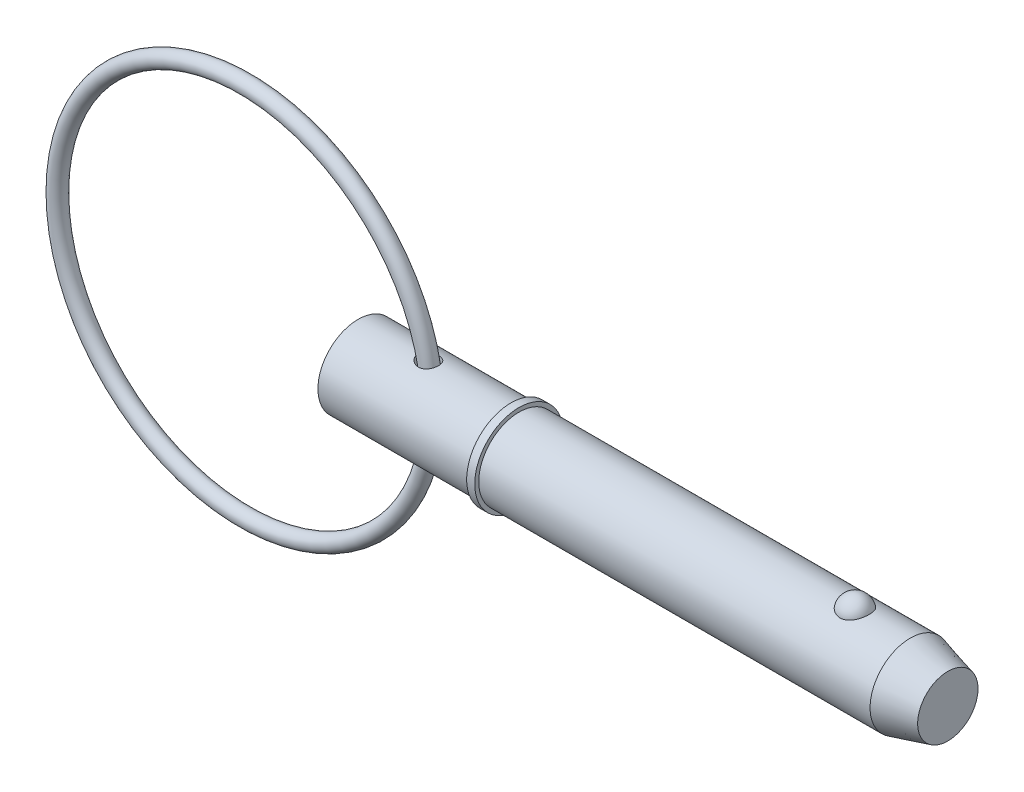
ISO-10303-21;
HEADER;
FILE_DESCRIPTION(('STEP AP214'),'2;1');
FILE_NAME('part.step','',(''),(''),'','','');
FILE_SCHEMA(('AUTOMOTIVE_DESIGN { 1 0 10303 214 1 1 1 1 }'));
ENDSEC;
DATA;
#1=APPLICATION_CONTEXT('core data for automotive mechanical design processes');
#2=APPLICATION_PROTOCOL_DEFINITION('international standard','automotive_design',2000,#1);
#3=PRODUCT_CONTEXT('',#1,'mechanical');
#4=PRODUCT('Part','Part','',(#3));
#5=PRODUCT_RELATED_PRODUCT_CATEGORY('part','',(#4));
#6=PRODUCT_DEFINITION_FORMATION('','',#4);
#7=PRODUCT_DEFINITION_CONTEXT('part definition',#1,'design');
#8=PRODUCT_DEFINITION('design','',#6,#7);
#9=PRODUCT_DEFINITION_SHAPE('','',#8);
#10=(LENGTH_UNIT() NAMED_UNIT(*) SI_UNIT(.MILLI.,.METRE.));
#11=(NAMED_UNIT(*) PLANE_ANGLE_UNIT() SI_UNIT($,.RADIAN.));
#12=(NAMED_UNIT(*) SI_UNIT($,.STERADIAN.) SOLID_ANGLE_UNIT());
#13=UNCERTAINTY_MEASURE_WITH_UNIT(LENGTH_MEASURE(1.E-05),#10,'distance_accuracy_value','');
#14=(GEOMETRIC_REPRESENTATION_CONTEXT(3) GLOBAL_UNCERTAINTY_ASSIGNED_CONTEXT((#13)) GLOBAL_UNIT_ASSIGNED_CONTEXT((#10,
#11,#12)) REPRESENTATION_CONTEXT('',''));
#15=CARTESIAN_POINT('',(0.,0.,0.));
#16=DIRECTION('',(0.,0.,1.));
#17=DIRECTION('',(1.,0.,0.));
#18=AXIS2_PLACEMENT_3D('',#15,#16,#17);
#19=CARTESIAN_POINT('',(-13.4013067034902,0.,0.));
#20=DIRECTION('',(0.,0.,1.));
#21=DIRECTION('',(1.,0.,0.));
#22=AXIS2_PLACEMENT_3D('',#19,#20,#21);
#23=TOROIDAL_SURFACE('',#22,22.225,0.952999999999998);
#24=CARTESIAN_POINT('',(9.77669329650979,0.,0.));
#25=VERTEX_POINT('',#24);
#26=VERTEX_LOOP('',#25);
#27=FACE_BOUND('',#26,.T.);
#28=ADVANCED_FACE('P0_F12',(#27),#23,.T.);
#29=CLOSED_SHELL('',(#28));
#30=MANIFOLD_SOLID_BREP('P0_B1',#29);
#31=CARTESIAN_POINT('',(0.,0.,0.));
#32=DIRECTION('',(1.,0.,0.));
#33=DIRECTION('',(0.,0.,-1.));
#34=AXIS2_PLACEMENT_3D('',#31,#32,#33);
#35=CYLINDRICAL_SURFACE('',#34,4.765);
#36=CARTESIAN_POINT('',(7.31773584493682,4.71580709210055,-0.682926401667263));
#37=CARTESIAN_POINT('',(7.3607471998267,4.70750812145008,-0.740230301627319));
#38=CARTESIAN_POINT('',(7.40883112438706,4.69869300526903,-0.79371122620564));
#39=CARTESIAN_POINT('',(7.51340999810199,4.68106981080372,-0.89180043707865));
#40=CARTESIAN_POINT('',(7.56991882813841,4.67226176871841,-0.936393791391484));
#41=CARTESIAN_POINT('',(7.689548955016,4.65568581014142,-1.01560363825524));
#42=CARTESIAN_POINT('',(7.75265928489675,4.64791621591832,-1.05023633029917));
#43=CARTESIAN_POINT('',(7.88387110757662,4.6343185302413,-1.10870278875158));
#44=CARTESIAN_POINT('',(7.95197058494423,4.62848966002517,-1.13254088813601));
#45=CARTESIAN_POINT('',(8.09209413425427,4.6194749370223,-1.16877415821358));
#46=CARTESIAN_POINT('',(8.16415141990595,4.6163169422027,-1.18104886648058));
#47=CARTESIAN_POINT('',(8.30937958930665,4.61324608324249,-1.19299123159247));
#48=CARTESIAN_POINT('',(8.38255011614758,4.61333220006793,-1.19266284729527));
#49=CARTESIAN_POINT('',(8.52374186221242,4.61674026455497,-1.17939593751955));
#50=CARTESIAN_POINT('',(8.59183022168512,4.61989017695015,-1.16712781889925));
#51=CARTESIAN_POINT('',(8.72470143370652,4.62884731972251,-1.13107903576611));
#52=CARTESIAN_POINT('',(8.78948513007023,4.63465386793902,-1.10730132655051));
#53=CARTESIAN_POINT('',(8.91088768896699,4.64792402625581,-1.05016249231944));
#54=CARTESIAN_POINT('',(8.96774302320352,4.65530108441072,-1.01728198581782));
#55=CARTESIAN_POINT('',(9.07499804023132,4.67102002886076,-0.942471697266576));
#56=CARTESIAN_POINT('',(9.12539777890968,4.6793619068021,-0.900541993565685));
#57=CARTESIAN_POINT('',(9.21836221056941,4.69607497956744,-0.808868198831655));
#58=CARTESIAN_POINT('',(9.26093651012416,4.70444612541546,-0.759133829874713));
#59=CARTESIAN_POINT('',(9.33728390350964,4.72032100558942,-0.653192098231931));
#60=CARTESIAN_POINT('',(9.3710564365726,4.72782468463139,-0.596984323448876));
#61=CARTESIAN_POINT('',(9.42940600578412,4.74126034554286,-0.478808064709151));
#62=CARTESIAN_POINT('',(9.45384681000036,4.74716869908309,-0.416769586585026));
#63=CARTESIAN_POINT('',(9.49226260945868,4.75663465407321,-0.289362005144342));
#64=CARTESIAN_POINT('',(9.50623742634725,4.76019221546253,-0.22399284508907));
#65=CARTESIAN_POINT('',(9.52342004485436,4.76458450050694,-0.0914886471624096));
#66=CARTESIAN_POINT('',(9.52658321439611,4.7654079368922,-0.0243474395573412));
#67=CARTESIAN_POINT('',(9.52194012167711,4.76421136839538,0.109528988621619));
#68=CARTESIAN_POINT('',(9.51413380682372,4.7621913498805,0.176264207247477));
#69=CARTESIAN_POINT('',(9.48775485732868,4.75552896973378,0.307367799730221));
#70=CARTESIAN_POINT('',(9.4691926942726,4.75088915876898,0.371738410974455));
#71=CARTESIAN_POINT('',(9.42175836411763,4.73949008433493,0.496364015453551));
#72=CARTESIAN_POINT('',(9.39288586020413,4.73273075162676,0.556618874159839));
#73=CARTESIAN_POINT('',(9.32549385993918,4.71782154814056,0.671371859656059));
#74=CARTESIAN_POINT('',(9.28696367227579,4.70967013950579,0.725863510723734));
#75=CARTESIAN_POINT('',(9.20123305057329,4.6928883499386,0.827453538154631));
#76=CARTESIAN_POINT('',(9.15403300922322,4.68425799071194,0.874552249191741));
#77=CARTESIAN_POINT('',(9.05250467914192,4.66754854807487,0.959736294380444));
#78=CARTESIAN_POINT('',(8.99822095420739,4.65946646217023,0.997874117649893));
#79=CARTESIAN_POINT('',(8.88381123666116,4.64472049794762,1.06440739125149));
#80=CARTESIAN_POINT('',(8.82368614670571,4.63805640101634,1.09280434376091));
#81=CARTESIAN_POINT('',(8.70022952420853,4.62698068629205,1.13878427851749));
#82=CARTESIAN_POINT('',(8.63695594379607,4.62253830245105,1.15651569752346));
#83=CARTESIAN_POINT('',(8.50825296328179,4.61622454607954,1.18146656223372));
#84=CARTESIAN_POINT('',(8.44282353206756,4.61435321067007,1.18868585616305));
#85=CARTESIAN_POINT('',(8.31119087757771,4.61332122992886,1.19268442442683));
#86=CARTESIAN_POINT('',(8.24498542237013,4.61417920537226,1.18939198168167));
#87=CARTESIAN_POINT('',(8.11397487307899,4.61847671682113,1.17259121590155));
#88=CARTESIAN_POINT('',(8.04917011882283,4.62191687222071,1.15908044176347));
#89=CARTESIAN_POINT('',(7.91946226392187,4.63117528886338,1.12153047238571));
#90=CARTESIAN_POINT('',(7.85470460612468,4.6371000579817,1.09701575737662));
#91=CARTESIAN_POINT('',(7.7300035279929,4.65063246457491,1.03814807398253));
#92=CARTESIAN_POINT('',(7.67006197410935,4.65824075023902,1.00379131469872));
#93=CARTESIAN_POINT('',(7.55352765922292,4.67473656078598,0.924015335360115));
#94=CARTESIAN_POINT('',(7.49726947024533,4.68366994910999,0.878115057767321));
#95=CARTESIAN_POINT('',(7.39344083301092,4.70144936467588,0.777311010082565));
#96=CARTESIAN_POINT('',(7.34587087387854,4.71029538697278,0.722406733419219));
#97=CARTESIAN_POINT('',(7.26188955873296,4.72669773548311,0.605773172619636));
#98=CARTESIAN_POINT('',(7.22531316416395,4.73427229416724,0.544165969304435));
#99=CARTESIAN_POINT('',(7.16406269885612,4.74732663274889,0.415095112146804));
#100=CARTESIAN_POINT('',(7.13937848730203,4.75280819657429,0.347636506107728));
#101=CARTESIAN_POINT('',(7.10494917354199,4.7605495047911,0.215359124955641));
#102=CARTESIAN_POINT('',(7.09405441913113,4.76305589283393,0.150853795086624));
#103=CARTESIAN_POINT('',(7.08387189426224,4.76539656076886,0.0208839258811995));
#104=CARTESIAN_POINT('',(7.0845805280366,4.76523166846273,-0.0445803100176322));
#105=CARTESIAN_POINT('',(7.09709111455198,4.76236014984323,-0.169693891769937));
#106=CARTESIAN_POINT('',(7.10810913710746,4.75983315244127,-0.229428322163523));
#107=CARTESIAN_POINT('',(7.13959099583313,4.75276726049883,-0.346187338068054));
#108=CARTESIAN_POINT('',(7.16004881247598,4.7482296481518,-0.403213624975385));
#109=CARTESIAN_POINT('',(7.20270325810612,4.73907067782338,-0.498040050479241));
#110=CARTESIAN_POINT('',(7.22286864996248,4.73481668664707,-0.536809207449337));
#111=CARTESIAN_POINT('',(7.26730952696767,4.72570777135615,-0.611832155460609));
#112=CARTESIAN_POINT('',(7.29158512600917,4.72085283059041,-0.64808587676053));
#113=CARTESIAN_POINT('',(7.31773584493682,4.71580709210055,-0.682926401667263));
#114=B_SPLINE_CURVE_WITH_KNOTS('',3,(#36,#37,#38,#39,#40,#41,#42,#43,#44,#45,#46,#47,#48,#49,
#50,#51,#52,#53,#54,#55,#56,#57,#58,#59,#60,#61,#62,#63,#64,#65,#66,#67,#68,#69,#70,#71,#72,#73,
#74,#75,#76,#77,#78,#79,#80,#81,#82,#83,#84,#85,#86,#87,#88,#89,#90,#91,#92,#93,#94,#95,#96,#97,
#98,#99,#100,#101,#102,#103,#104,#105,#106,#107,#108,#109,#110,#111,#112,#113),.UNSPECIFIED.,
.T.,.F.,(4,2,2,2,2,2,2,2,2,2,2,2,2,2,2,2,2,2,2,2,2,2,2,2,2,2,2,2,2,2,2,2,2,2,2,2,2,2,4),(0.,
0.216219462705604,0.432799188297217,0.649024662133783,0.865163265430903,1.08352938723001,
1.30182691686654,1.50853487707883,1.71518978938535,1.91252381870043,2.1098561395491,
2.30694457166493,2.50404555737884,2.70392296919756,2.90380378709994,3.10450875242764,
3.30521468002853,3.5057255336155,3.70624293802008,3.90698330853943,4.10771458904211,
4.30723900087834,4.50673262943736,4.70338139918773,4.90003300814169,5.09802914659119,
5.29607279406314,5.5036500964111,5.7113074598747,5.92972727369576,6.14815938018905,
6.36312650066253,6.57790998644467,6.77325899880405,6.96854747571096,7.15009726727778,
7.33153144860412,7.46298830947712,7.59444881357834),.UNSPECIFIED.);
#115=CARTESIAN_POINT('',(7.31773584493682,4.71580709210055,-0.682926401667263));
#116=VERTEX_POINT('',#115);
#117=EDGE_CURVE('P1_E42',#116,#116,#114,.T.);
#118=ORIENTED_EDGE('',*,*,#117,.T.);
#119=EDGE_LOOP('',(#118));
#120=FACE_BOUND('',#119,.T.);
#121=CARTESIAN_POINT('',(0.,0.,0.));
#122=DIRECTION('',(1.,0.,0.));
#123=DIRECTION('',(0.,0.,-1.));
#124=AXIS2_PLACEMENT_3D('',#121,#122,#123);
#125=CIRCLE('',#124,4.765);
#126=CARTESIAN_POINT('',(0.,0.,-4.765));
#127=VERTEX_POINT('',#126);
#128=EDGE_CURVE('P1_E9',#127,#127,#125,.T.);
#129=ORIENTED_EDGE('',*,*,#128,.T.);
#130=EDGE_LOOP('',(#129));
#131=FACE_BOUND('',#130,.T.);
#132=CARTESIAN_POINT('',(18.097,0.,0.));
#133=DIRECTION('',(1.,0.,0.));
#134=DIRECTION('',(0.,0.,-1.));
#135=AXIS2_PLACEMENT_3D('',#132,#133,#134);
#136=CIRCLE('',#135,4.765);
#137=CARTESIAN_POINT('',(18.097,0.,-4.765));
#138=VERTEX_POINT('',#137);
#139=EDGE_CURVE('P1_E25',#138,#138,#136,.T.);
#140=ORIENTED_EDGE('',*,*,#139,.F.);
#141=EDGE_LOOP('',(#140));
#142=FACE_BOUND('',#141,.T.);
#143=CARTESIAN_POINT('',(7.31773584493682,-4.71580709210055,-0.682926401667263));
#144=CARTESIAN_POINT('',(7.27956054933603,-4.72317282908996,-0.63206220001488));
#145=CARTESIAN_POINT('',(7.24535712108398,-4.7301361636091,-0.578155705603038));
#146=CARTESIAN_POINT('',(7.18611785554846,-4.74256090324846,-0.465352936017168));
#147=CARTESIAN_POINT('',(7.16107836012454,-4.74802290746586,-0.406458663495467));
#148=CARTESIAN_POINT('',(7.12119149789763,-4.75686558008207,-0.284913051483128));
#149=CARTESIAN_POINT('',(7.1063796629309,-4.76023898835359,-0.222249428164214));
#150=CARTESIAN_POINT('',(7.08786546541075,-4.76447177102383,-0.0952170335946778));
#151=CARTESIAN_POINT('',(7.08416018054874,-4.76533180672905,-0.0308487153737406));
#152=CARTESIAN_POINT('',(7.08795686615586,-4.76445764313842,0.0942755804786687));
#153=CARTESIAN_POINT('',(7.09490366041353,-4.762851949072,0.155050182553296));
#154=CARTESIAN_POINT('',(7.11863973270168,-4.75746086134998,0.2745356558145));
#155=CARTESIAN_POINT('',(7.13542953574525,-4.75367535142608,0.333246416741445));
#156=CARTESIAN_POINT('',(7.17817193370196,-4.74430545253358,0.447305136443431));
#157=CARTESIAN_POINT('',(7.20415836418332,-4.73871442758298,0.502639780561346));
#158=CARTESIAN_POINT('',(7.26428068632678,-4.72628508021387,0.608523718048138));
#159=CARTESIAN_POINT('',(7.29841897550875,-4.71944639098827,0.659071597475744));
#160=CARTESIAN_POINT('',(7.37680984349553,-4.70456239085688,0.758311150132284));
#161=CARTESIAN_POINT('',(7.42165519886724,-4.69646426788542,0.806526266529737));
#162=CARTESIAN_POINT('',(7.51828933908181,-4.68032890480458,0.895428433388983));
#163=CARTESIAN_POINT('',(7.57008134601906,-4.67229169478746,0.936111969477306));
#164=CARTESIAN_POINT('',(7.68397204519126,-4.65640659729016,1.01229731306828));
#165=CARTESIAN_POINT('',(7.74657226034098,-4.64863251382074,1.04706751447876));
#166=CARTESIAN_POINT('',(7.87680110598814,-4.6349740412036,1.10596507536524));
#167=CARTESIAN_POINT('',(7.94443054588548,-4.62908995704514,1.13009071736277));
#168=CARTESIAN_POINT('',(8.08402017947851,-4.61989019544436,1.16713943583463));
#169=CARTESIAN_POINT('',(8.15603143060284,-4.61661596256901,1.17988211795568));
#170=CARTESIAN_POINT('',(8.30124697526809,-4.61330446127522,1.1927680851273));
#171=CARTESIAN_POINT('',(8.37445077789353,-4.61326589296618,1.19291642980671));
#172=CARTESIAN_POINT('',(8.51584800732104,-4.61644036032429,1.18056687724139));
#173=CARTESIAN_POINT('',(8.58410302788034,-4.61948317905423,1.16873099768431));
#174=CARTESIAN_POINT('',(8.71738052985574,-4.6282520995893,1.13350536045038));
#175=CARTESIAN_POINT('',(8.78240382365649,-4.63397752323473,1.11011852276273));
#176=CARTESIAN_POINT('',(8.90428519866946,-4.64711877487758,1.05371003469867));
#177=CARTESIAN_POINT('',(8.96138096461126,-4.6544450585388,1.02117932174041));
#178=CARTESIAN_POINT('',(9.06916653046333,-4.6700970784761,0.947021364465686));
#179=CARTESIAN_POINT('',(9.11985639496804,-4.67842280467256,0.905394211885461));
#180=CARTESIAN_POINT('',(9.2134071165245,-4.69513303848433,0.814300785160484));
#181=CARTESIAN_POINT('',(9.25628268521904,-4.70351740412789,0.764849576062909));
#182=CARTESIAN_POINT('',(9.33327173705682,-4.71945185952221,0.659422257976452));
#183=CARTESIAN_POINT('',(9.3673846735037,-4.72700189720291,0.603445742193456));
#184=CARTESIAN_POINT('',(9.42645214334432,-4.74055953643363,0.485673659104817));
#185=CARTESIAN_POINT('',(9.45127042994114,-4.74654383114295,0.423807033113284));
#186=CARTESIAN_POINT('',(9.49046298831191,-4.756182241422,0.296676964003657));
#187=CARTESIAN_POINT('',(9.50483706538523,-4.75983631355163,0.231413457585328));
#188=CARTESIAN_POINT('',(9.52283408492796,-4.76443282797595,0.0990368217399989));
#189=CARTESIAN_POINT('',(9.52641016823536,-4.76536345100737,0.0319169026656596));
#190=CARTESIAN_POINT('',(9.52259067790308,-4.76437893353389,-0.101988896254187));
#191=CARTESIAN_POINT('',(9.5151950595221,-4.76246378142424,-0.168774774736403));
#192=CARTESIAN_POINT('',(9.48962516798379,-4.75599746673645,-0.300048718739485));
#193=CARTESIAN_POINT('',(9.4714615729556,-4.75144891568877,-0.364538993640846));
#194=CARTESIAN_POINT('',(9.42480303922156,-4.74020887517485,-0.489470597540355));
#195=CARTESIAN_POINT('',(9.396307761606,-4.73351731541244,-0.549911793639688));
#196=CARTESIAN_POINT('',(9.32963953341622,-4.71871240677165,-0.665099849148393));
#197=CARTESIAN_POINT('',(9.29145577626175,-4.71059747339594,-0.719840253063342));
#198=CARTESIAN_POINT('',(9.20637695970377,-4.69385254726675,-0.82198328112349));
#199=CARTESIAN_POINT('',(9.15948227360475,-4.68522257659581,-0.869386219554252));
#200=CARTESIAN_POINT('',(9.05849937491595,-4.66847516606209,-0.955233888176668));
#201=CARTESIAN_POINT('',(9.00445430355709,-4.6603550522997,-0.993728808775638));
#202=CARTESIAN_POINT('',(8.8904576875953,-4.64550122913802,-1.06100691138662));
#203=CARTESIAN_POINT('',(8.83050704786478,-4.63876730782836,-1.08979157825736));
#204=CARTESIAN_POINT('',(8.70732873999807,-4.6275305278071,-1.13655620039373));
#205=CARTESIAN_POINT('',(8.64416019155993,-4.62299714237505,-1.15468477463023));
#206=CARTESIAN_POINT('',(8.51559711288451,-4.61649071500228,-1.18043067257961));
#207=CARTESIAN_POINT('',(8.4502025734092,-4.61451768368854,-1.18804795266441));
#208=CARTESIAN_POINT('',(8.31862013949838,-4.61328355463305,-1.19283094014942));
#209=CARTESIAN_POINT('',(8.25242983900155,-4.61403911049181,-1.18993246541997));
#210=CARTESIAN_POINT('',(8.12138461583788,-4.61814057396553,-1.17391149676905));
#211=CARTESIAN_POINT('',(8.0565300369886,-4.62148714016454,-1.16078640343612));
#212=CARTESIAN_POINT('',(7.92669960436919,-4.63056912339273,-1.12402333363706));
#213=CARTESIAN_POINT('',(7.86186447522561,-4.63641051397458,-1.09991536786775));
#214=CARTESIAN_POINT('',(7.73694230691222,-4.64980121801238,-1.04185298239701));
#215=CARTESIAN_POINT('',(7.6768568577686,-4.65735110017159,-1.0078952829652));
#216=CARTESIAN_POINT('',(7.56207884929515,-4.67346080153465,-0.930364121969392));
#217=CARTESIAN_POINT('',(7.5074784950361,-4.68203382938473,-0.886656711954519));
#218=CARTESIAN_POINT('',(7.40624045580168,-4.69916824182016,-0.79082583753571));
#219=CARTESIAN_POINT('',(7.35959988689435,-4.7077296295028,-0.738705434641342));
#220=CARTESIAN_POINT('',(7.31773584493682,-4.71580709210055,-0.682926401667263));
#221=B_SPLINE_CURVE_WITH_KNOTS('',3,(#143,#144,#145,#146,#147,#148,#149,#150,#151,#152,#153,
#154,#155,#156,#157,#158,#159,#160,#161,#162,#163,#164,#165,#166,#167,#168,#169,#170,#171,#172,
#173,#174,#175,#176,#177,#178,#179,#180,#181,#182,#183,#184,#185,#186,#187,#188,#189,#190,#191,
#192,#193,#194,#195,#196,#197,#198,#199,#200,#201,#202,#203,#204,#205,#206,#207,#208,#209,#210,
#211,#212,#213,#214,#215,#216,#217,#218,#219,#220),.UNSPECIFIED.,.T.,.F.,(4,2,2,2,2,2,2,2,2,2,2,
2,2,2,2,2,2,2,2,2,2,2,2,2,2,2,2,2,2,2,2,2,2,2,2,2,2,2,4),(0.,0.191851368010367,0.38362606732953,
0.576063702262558,0.768450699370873,0.951145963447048,1.13385097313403,1.31723528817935,
1.50067360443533,1.69887079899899,1.8971602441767,2.11225870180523,2.32739185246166,
2.54587681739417,2.76427400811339,2.97123130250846,3.17813630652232,3.37555441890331,
3.57297054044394,3.77001106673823,3.96706388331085,4.16690159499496,4.36674303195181,
4.56745046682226,4.76815872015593,4.96866827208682,5.16918440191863,5.36992517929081,
5.5706573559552,5.77022940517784,5.96977092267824,6.16645904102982,6.36314797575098,
6.56103940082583,6.75898114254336,6.96633026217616,7.17374850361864,7.384214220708,
7.59460352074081),.UNSPECIFIED.);
#222=CARTESIAN_POINT('',(7.31773584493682,-4.71580709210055,-0.682926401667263));
#223=VERTEX_POINT('',#222);
#224=EDGE_CURVE('P1_E17',#223,#223,#221,.T.);
#225=ORIENTED_EDGE('',*,*,#224,.T.);
#226=EDGE_LOOP('',(#225));
#227=FACE_BOUND('',#226,.T.);
#228=ADVANCED_FACE('P1_F13',(#120,#131,#142,#227),#35,.T.);
#229=CARTESIAN_POINT('',(0.,0.,0.));
#230=DIRECTION('',(1.,0.,0.));
#231=DIRECTION('',(0.,0.,-1.));
#232=AXIS2_PLACEMENT_3D('',#229,#230,#231);
#233=CYLINDRICAL_SURFACE('',#232,4.765);
#234=CARTESIAN_POINT('',(65.4041944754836,0.,0.));
#235=DIRECTION('',(1.,0.,0.));
#236=DIRECTION('',(0.,0.,-1.));
#237=AXIS2_PLACEMENT_3D('',#234,#235,#236);
#238=CIRCLE('',#237,4.765);
#239=CARTESIAN_POINT('',(65.4041944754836,0.,-4.765));
#240=VERTEX_POINT('',#239);
#241=EDGE_CURVE('P1_E99',#240,#240,#238,.T.);
#242=ORIENTED_EDGE('',*,*,#241,.F.);
#243=EDGE_LOOP('',(#242));
#244=FACE_BOUND('',#243,.T.);
#245=CARTESIAN_POINT('',(19.05,0.,0.));
#246=DIRECTION('',(1.,0.,0.));
#247=DIRECTION('',(0.,0.,-1.));
#248=AXIS2_PLACEMENT_3D('',#245,#246,#247);
#249=CIRCLE('',#248,4.765);
#250=CARTESIAN_POINT('',(19.05,0.,-4.765));
#251=VERTEX_POINT('',#250);
#252=EDGE_CURVE('P1_E96',#251,#251,#249,.T.);
#253=ORIENTED_EDGE('',*,*,#252,.T.);
#254=EDGE_LOOP('',(#253));
#255=FACE_BOUND('',#254,.T.);
#256=CARTESIAN_POINT('',(58.8510202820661,4.42764777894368,1.76101111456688));
#257=CARTESIAN_POINT('',(58.7597212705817,4.42764470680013,1.76101422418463));
#258=CARTESIAN_POINT('',(58.6684468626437,4.43059091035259,1.75366340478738));
#259=CARTESIAN_POINT('',(58.4886154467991,4.44201846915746,1.72451180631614));
#260=CARTESIAN_POINT('',(58.4000577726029,4.45049845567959,1.70271460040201));
#261=CARTESIAN_POINT('',(58.2282570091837,4.47200516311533,1.64539370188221));
#262=CARTESIAN_POINT('',(58.1450064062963,4.48502527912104,1.60988994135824));
#263=CARTESIAN_POINT('',(57.9857633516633,4.51419542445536,1.52617873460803));
#264=CARTESIAN_POINT('',(57.9097723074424,4.53034605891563,1.47796883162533));
#265=CARTESIAN_POINT('',(57.7647445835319,4.5645931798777,1.36860494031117));
#266=CARTESIAN_POINT('',(57.6959645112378,4.58273170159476,1.30712420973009));
#267=CARTESIAN_POINT('',(57.5693423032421,4.61870302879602,1.17370204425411));
#268=CARTESIAN_POINT('',(57.5115021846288,4.63653577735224,1.10175868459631));
#269=CARTESIAN_POINT('',(57.4055709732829,4.67090140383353,0.945806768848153));
#270=CARTESIAN_POINT('',(57.3580305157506,4.68734068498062,0.861402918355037));
#271=CARTESIAN_POINT('',(57.2770817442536,4.71628466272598,0.68544236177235));
#272=CARTESIAN_POINT('',(57.2436747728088,4.72878898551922,0.593884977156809));
#273=CARTESIAN_POINT('',(57.191287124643,4.74874061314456,0.404781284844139));
#274=CARTESIAN_POINT('',(57.1725178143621,4.75611366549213,0.307168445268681));
#275=CARTESIAN_POINT('',(57.1505846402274,4.76475393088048,0.109940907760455));
#276=CARTESIAN_POINT('',(57.1474205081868,4.76602124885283,0.0103262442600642));
#277=CARTESIAN_POINT('',(57.1567405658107,4.76232928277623,-0.187629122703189));
#278=CARTESIAN_POINT('',(57.1691588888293,4.7573962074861,-0.285973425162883));
#279=CARTESIAN_POINT('',(57.2092804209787,4.74184975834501,-0.479027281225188));
#280=CARTESIAN_POINT('',(57.2369839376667,4.7312362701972,-0.573736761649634));
#281=CARTESIAN_POINT('',(57.3071581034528,4.70540026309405,-0.756973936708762));
#282=CARTESIAN_POINT('',(57.3496460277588,4.69017235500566,-0.845494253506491));
#283=CARTESIAN_POINT('',(57.448520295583,4.6566986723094,-1.01378033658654));
#284=CARTESIAN_POINT('',(57.5049076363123,4.63845268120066,-1.09354547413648));
#285=CARTESIAN_POINT('',(57.630552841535,4.60085438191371,-1.24228523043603));
#286=CARTESIAN_POINT('',(57.6998439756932,4.58149930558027,-1.31123108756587));
#287=CARTESIAN_POINT('',(57.8496066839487,4.54391653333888,-1.43607409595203));
#288=CARTESIAN_POINT('',(57.9300771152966,4.52568872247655,-1.49197257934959));
#289=CARTESIAN_POINT('',(58.0981500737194,4.49293007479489,-1.58786764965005));
#290=CARTESIAN_POINT('',(58.1855445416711,4.47832346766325,-1.62820219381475));
#291=CARTESIAN_POINT('',(58.366553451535,4.45406011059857,-1.69345757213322));
#292=CARTESIAN_POINT('',(58.4601655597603,4.44440151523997,-1.71838415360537));
#293=CARTESIAN_POINT('',(58.6458939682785,4.43159888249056,-1.75112843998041));
#294=CARTESIAN_POINT('',(58.737849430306,4.42815213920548,-1.75974223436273));
#295=CARTESIAN_POINT('',(58.9219658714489,4.427247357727,-1.76201865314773));
#296=CARTESIAN_POINT('',(59.0141268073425,4.42978816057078,-1.7556841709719));
#297=CARTESIAN_POINT('',(59.1931292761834,4.4403864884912,-1.72869560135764));
#298=CARTESIAN_POINT('',(59.2800474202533,4.44827555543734,-1.70847853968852));
#299=CARTESIAN_POINT('',(59.4491314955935,4.46852246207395,-1.65479562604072));
#300=CARTESIAN_POINT('',(59.5312970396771,4.48088066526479,-1.62132869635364));
#301=CARTESIAN_POINT('',(59.6905916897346,4.50907357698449,-1.54120560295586));
#302=CARTESIAN_POINT('',(59.7675700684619,4.52497884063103,-1.49427526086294));
#303=CARTESIAN_POINT('',(59.9127080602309,4.55845148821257,-1.38881222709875));
#304=CARTESIAN_POINT('',(59.9808656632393,4.57601924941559,-1.33027689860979));
#305=CARTESIAN_POINT('',(60.1100990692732,4.61196537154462,-1.19991049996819));
#306=CARTESIAN_POINT('',(60.1706562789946,4.63034074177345,-1.12756415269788));
#307=CARTESIAN_POINT('',(60.2792797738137,4.66513959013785,-0.973612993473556));
#308=CARTESIAN_POINT('',(60.3273438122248,4.68156271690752,-0.8920065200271));
#309=CARTESIAN_POINT('',(60.411383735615,4.71130224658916,-0.718892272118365));
#310=CARTESIAN_POINT('',(60.4469185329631,4.724501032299,-0.627149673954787));
#311=CARTESIAN_POINT('',(60.5029522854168,4.74571823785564,-0.438611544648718));
#312=CARTESIAN_POINT('',(60.523450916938,4.75373654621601,-0.341815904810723));
#313=CARTESIAN_POINT('',(60.5490338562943,4.76378905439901,-0.145633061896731));
#314=CARTESIAN_POINT('',(60.554076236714,4.76580697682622,-0.046239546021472));
#315=CARTESIAN_POINT('',(60.5485239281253,4.76360573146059,0.15203857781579));
#316=CARTESIAN_POINT('',(60.5379294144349,4.75938663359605,0.250923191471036));
#317=CARTESIAN_POINT('',(60.5013875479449,4.74516937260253,0.445004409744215));
#318=CARTESIAN_POINT('',(60.4754964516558,4.73519238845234,0.540213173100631));
#319=CARTESIAN_POINT('',(60.4089273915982,4.7104939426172,0.724662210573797));
#320=CARTESIAN_POINT('',(60.368248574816,4.69577220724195,0.81390214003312));
#321=CARTESIAN_POINT('',(60.2727177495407,4.66303767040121,0.984313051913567));
#322=CARTESIAN_POINT('',(60.2178042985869,4.64501070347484,1.06544688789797));
#323=CARTESIAN_POINT('',(60.0950496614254,4.60764678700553,1.21692673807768));
#324=CARTESIAN_POINT('',(60.0272086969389,4.58830985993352,1.2872729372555));
#325=CARTESIAN_POINT('',(59.8805480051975,4.55060370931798,1.41479271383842));
#326=CARTESIAN_POINT('',(59.8017918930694,4.53222967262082,1.47203785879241));
#327=CARTESIAN_POINT('',(59.6349890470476,4.49849576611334,1.57212016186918));
#328=CARTESIAN_POINT('',(59.5469417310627,4.48313608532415,1.61495641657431));
#329=CARTESIAN_POINT('',(59.3597918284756,4.45676184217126,1.68642657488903));
#330=CARTESIAN_POINT('',(59.2603653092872,4.44598302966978,1.71430590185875));
#331=CARTESIAN_POINT('',(59.0576210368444,4.43142918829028,1.75159258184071));
#332=CARTESIAN_POINT('',(58.9543049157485,4.42765125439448,1.76100759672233));
#333=CARTESIAN_POINT('',(58.8510202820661,4.42764777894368,1.76101111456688));
#334=B_SPLINE_CURVE_WITH_KNOTS('',3,(#256,#257,#258,#259,#260,#261,#262,#263,#264,#265,#266,
#267,#268,#269,#270,#271,#272,#273,#274,#275,#276,#277,#278,#279,#280,#281,#282,#283,#284,#285,
#286,#287,#288,#289,#290,#291,#292,#293,#294,#295,#296,#297,#298,#299,#300,#301,#302,#303,#304,
#305,#306,#307,#308,#309,#310,#311,#312,#313,#314,#315,#316,#317,#318,#319,#320,#321,#322,#323,
#324,#325,#326,#327,#328,#329,#330,#331,#332,#333),.UNSPECIFIED.,.T.,.F.,(4,2,2,2,2,2,2,2,2,2,2,
2,2,2,2,2,2,2,2,2,2,2,2,2,2,2,2,2,2,2,2,2,2,2,2,2,2,2,4),(0.,0.273517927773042,
0.546968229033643,0.820022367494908,1.09312934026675,1.37393946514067,1.65480131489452,
1.94820420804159,2.24163496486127,2.53922817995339,2.8368162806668,3.13315071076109,
3.42949110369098,3.72617893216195,4.02288805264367,4.32037303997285,4.61782764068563,
4.90840095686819,5.19886582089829,5.4747485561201,5.75057789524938,6.01809977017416,
6.28564340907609,6.55907787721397,6.83257454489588,7.11962987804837,7.40673679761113,
7.70312663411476,7.99952284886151,8.29672237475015,8.59391856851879,8.89002850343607,
9.18615552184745,9.483582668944,9.78100471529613,10.0767610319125,10.3725358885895,
10.6820893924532,10.991514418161),.UNSPECIFIED.);
#335=CARTESIAN_POINT('',(58.8510202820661,4.42764777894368,1.76101111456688));
#336=VERTEX_POINT('',#335);
#337=EDGE_CURVE('P1_E34',#336,#336,#334,.T.);
#338=ORIENTED_EDGE('',*,*,#337,.T.);
#339=EDGE_LOOP('',(#338));
#340=FACE_BOUND('',#339,.T.);
#341=ADVANCED_FACE('P1_F46',(#244,#255,#340),#233,.T.);
#342=CARTESIAN_POINT('',(0.,0.,0.));
#343=DIRECTION('',(-1.,0.,0.));
#344=DIRECTION('',(0.,0.,1.));
#345=AXIS2_PLACEMENT_3D('',#342,#343,#344);
#346=PLANE('',#345);
#347=ORIENTED_EDGE('',*,*,#128,.F.);
#348=EDGE_LOOP('',(#347));
#349=FACE_BOUND('',#348,.T.);
#350=ADVANCED_FACE('P1_F15',(#349),#346,.T.);
#351=CARTESIAN_POINT('',(18.097,4.765,0.));
#352=DIRECTION('',(-1.,0.,0.));
#353=DIRECTION('',(0.,0.,1.));
#354=AXIS2_PLACEMENT_3D('',#351,#352,#353);
#355=PLANE('',#354);
#356=ORIENTED_EDGE('',*,*,#139,.T.);
#357=EDGE_LOOP('',(#356));
#358=FACE_BOUND('',#357,.T.);
#359=CARTESIAN_POINT('',(18.097,0.,0.));
#360=DIRECTION('',(1.,0.,0.));
#361=DIRECTION('',(0.,0.,-1.));
#362=AXIS2_PLACEMENT_3D('',#359,#360,#361);
#363=CIRCLE('',#362,5.2415);
#364=CARTESIAN_POINT('',(18.097,0.,-5.2415));
#365=VERTEX_POINT('',#364);
#366=EDGE_CURVE('P1_E30',#365,#365,#363,.T.);
#367=ORIENTED_EDGE('',*,*,#366,.F.);
#368=EDGE_LOOP('',(#367));
#369=FACE_BOUND('',#368,.T.);
#370=ADVANCED_FACE('P1_F81',(#358,#369),#355,.T.);
#371=CARTESIAN_POINT('',(0.,0.,0.));
#372=DIRECTION('',(1.,0.,0.));
#373=DIRECTION('',(0.,0.,-1.));
#374=AXIS2_PLACEMENT_3D('',#371,#372,#373);
#375=CYLINDRICAL_SURFACE('',#374,5.2415);
#376=ORIENTED_EDGE('',*,*,#366,.T.);
#377=EDGE_LOOP('',(#376));
#378=FACE_BOUND('',#377,.T.);
#379=CARTESIAN_POINT('',(19.05,0.,0.));
#380=DIRECTION('',(1.,0.,0.));
#381=DIRECTION('',(0.,0.,-1.));
#382=AXIS2_PLACEMENT_3D('',#379,#380,#381);
#383=CIRCLE('',#382,5.2415);
#384=CARTESIAN_POINT('',(19.05,0.,-5.2415));
#385=VERTEX_POINT('',#384);
#386=EDGE_CURVE('P1_E95',#385,#385,#383,.T.);
#387=ORIENTED_EDGE('',*,*,#386,.F.);
#388=EDGE_LOOP('',(#387));
#389=FACE_BOUND('',#388,.T.);
#390=ADVANCED_FACE('P1_F68',(#378,#389),#375,.T.);
#391=CARTESIAN_POINT('',(19.05,5.2415,0.));
#392=DIRECTION('',(1.,0.,0.));
#393=DIRECTION('',(0.,0.,-1.));
#394=AXIS2_PLACEMENT_3D('',#391,#392,#393);
#395=PLANE('',#394);
#396=ORIENTED_EDGE('',*,*,#386,.T.);
#397=EDGE_LOOP('',(#396));
#398=FACE_BOUND('',#397,.T.);
#399=ORIENTED_EDGE('',*,*,#252,.F.);
#400=EDGE_LOOP('',(#399));
#401=FACE_BOUND('',#400,.T.);
#402=ADVANCED_FACE('P1_F62',(#398,#401),#395,.T.);
#403=CARTESIAN_POINT('',(69.85,0.,0.));
#404=DIRECTION('',(-1.,0.,0.));
#405=DIRECTION('',(0.,0.,1.));
#406=AXIS2_PLACEMENT_3D('',#403,#404,#405);
#407=CONICAL_SURFACE('',#406,3.57375000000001,0.26179938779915);
#408=ORIENTED_EDGE('',*,*,#241,.T.);
#409=EDGE_LOOP('',(#408));
#410=FACE_BOUND('',#409,.T.);
#411=CARTESIAN_POINT('',(69.85,0.,0.));
#412=DIRECTION('',(1.,0.,0.));
#413=DIRECTION('',(0.,0.,-1.));
#414=AXIS2_PLACEMENT_3D('',#411,#412,#413);
#415=CIRCLE('',#414,3.57375000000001);
#416=CARTESIAN_POINT('',(69.85,0.,-3.57375000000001));
#417=VERTEX_POINT('',#416);
#418=EDGE_CURVE('P1_E41',#417,#417,#415,.T.);
#419=ORIENTED_EDGE('',*,*,#418,.F.);
#420=EDGE_LOOP('',(#419));
#421=FACE_BOUND('',#420,.T.);
#422=ADVANCED_FACE('P1_F59',(#410,#421),#407,.T.);
#423=CARTESIAN_POINT('',(69.85,3.57375000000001,0.));
#424=DIRECTION('',(1.,0.,0.));
#425=DIRECTION('',(0.,0.,-1.));
#426=AXIS2_PLACEMENT_3D('',#423,#424,#425);
#427=PLANE('',#426);
#428=ORIENTED_EDGE('',*,*,#418,.T.);
#429=EDGE_LOOP('',(#428));
#430=FACE_BOUND('',#429,.T.);
#431=ADVANCED_FACE('P1_F55',(#430),#427,.T.);
#432=CARTESIAN_POINT('',(58.8510202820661,4.2885,0.));
#433=DIRECTION('',(-1.,0.,0.));
#434=DIRECTION('',(0.,1.,0.));
#435=AXIS2_PLACEMENT_3D('',#432,#433,#434);
#436=SPHERICAL_SURFACE('',#435,1.7665);
#437=ORIENTED_EDGE('',*,*,#337,.F.);
#438=EDGE_LOOP('',(#437));
#439=FACE_BOUND('',#438,.T.);
#440=ADVANCED_FACE('P1_F50',(#439),#436,.T.);
#441=CARTESIAN_POINT('',(-13.4013067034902,0.,0.));
#442=DIRECTION('',(0.,0.,1.));
#443=DIRECTION('',(1.,0.,0.));
#444=AXIS2_PLACEMENT_3D('',#441,#442,#443);
#445=TOROIDAL_SURFACE('',#444,22.225,1.19125);
#446=ORIENTED_EDGE('',*,*,#224,.F.);
#447=EDGE_LOOP('',(#446));
#448=FACE_BOUND('',#447,.T.);
#449=ORIENTED_EDGE('',*,*,#117,.F.);
#450=EDGE_LOOP('',(#449));
#451=FACE_BOUND('',#450,.T.);
#452=ADVANCED_FACE('P1_F54',(#448,#451),#445,.F.);
#453=CLOSED_SHELL('',(#228,#341,#350,#370,#390,#402,#422,#431,#440,#452));
#454=MANIFOLD_SOLID_BREP('P1_B1',#453);
#455=ADVANCED_BREP_SHAPE_REPRESENTATION('',(#18,#30,#454),#14);
#456=SHAPE_DEFINITION_REPRESENTATION(#9,#455);
ENDSEC;
END-ISO-10303-21;
